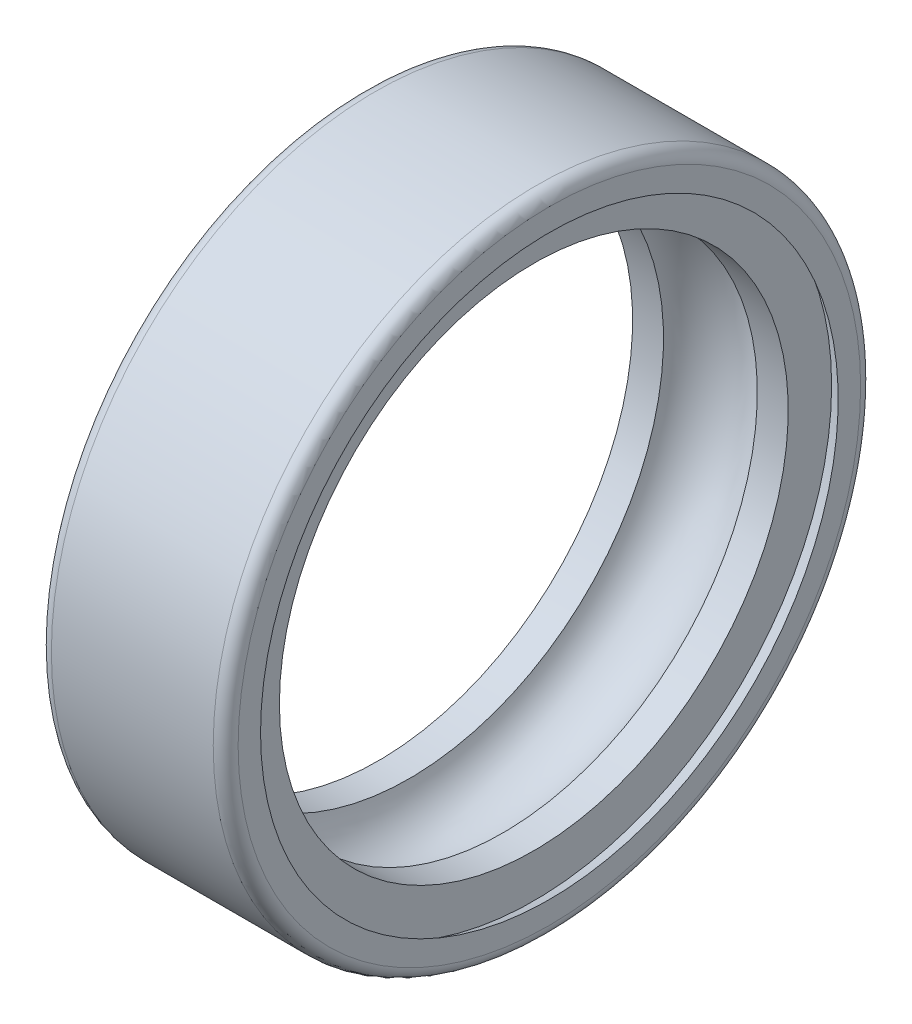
ISO-10303-21;
HEADER;
FILE_DESCRIPTION(('STEP AP214'),'2;1');
FILE_NAME('part.step','',(''),(''),'','','');
FILE_SCHEMA(('AUTOMOTIVE_DESIGN { 1 0 10303 214 1 1 1 1 }'));
ENDSEC;
DATA;
#1=APPLICATION_CONTEXT('core data for automotive mechanical design processes');
#2=APPLICATION_PROTOCOL_DEFINITION('international standard','automotive_design',2000,#1);
#3=PRODUCT_CONTEXT('',#1,'mechanical');
#4=PRODUCT('Part','Part','',(#3));
#5=PRODUCT_RELATED_PRODUCT_CATEGORY('part','',(#4));
#6=PRODUCT_DEFINITION_FORMATION('','',#4);
#7=PRODUCT_DEFINITION_CONTEXT('part definition',#1,'design');
#8=PRODUCT_DEFINITION('design','',#6,#7);
#9=PRODUCT_DEFINITION_SHAPE('','',#8);
#10=(LENGTH_UNIT() NAMED_UNIT(*) SI_UNIT(.MILLI.,.METRE.));
#11=(NAMED_UNIT(*) PLANE_ANGLE_UNIT() SI_UNIT($,.RADIAN.));
#12=(NAMED_UNIT(*) SI_UNIT($,.STERADIAN.) SOLID_ANGLE_UNIT());
#13=UNCERTAINTY_MEASURE_WITH_UNIT(LENGTH_MEASURE(1.E-05),#10,'distance_accuracy_value','');
#14=(GEOMETRIC_REPRESENTATION_CONTEXT(3) GLOBAL_UNCERTAINTY_ASSIGNED_CONTEXT((#13)) GLOBAL_UNIT_ASSIGNED_CONTEXT((#10,
#11,#12)) REPRESENTATION_CONTEXT('',''));
#15=CARTESIAN_POINT('',(0.,0.,0.));
#16=DIRECTION('',(0.,0.,1.));
#17=DIRECTION('',(1.,0.,0.));
#18=AXIS2_PLACEMENT_3D('',#15,#16,#17);
#19=CARTESIAN_POINT('',(0.,0.,0.));
#20=DIRECTION('',(-1.,0.,0.));
#21=DIRECTION('',(0.,0.,1.));
#22=AXIS2_PLACEMENT_3D('',#19,#20,#21);
#23=CYLINDRICAL_SURFACE('',#22,20.435);
#24=CARTESIAN_POINT('',(13.75,0.,0.));
#25=DIRECTION('',(-1.,0.,0.));
#26=DIRECTION('',(0.,0.,1.));
#27=AXIS2_PLACEMENT_3D('',#24,#25,#26);
#28=CIRCLE('',#27,20.435);
#29=CARTESIAN_POINT('',(13.75,0.,20.435));
#30=VERTEX_POINT('',#29);
#31=EDGE_CURVE('E10',#30,#30,#28,.T.);
#32=ORIENTED_EDGE('',*,*,#31,.F.);
#33=EDGE_LOOP('',(#32));
#34=FACE_BOUND('',#33,.T.);
#35=CARTESIAN_POINT('',(11.2680598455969,0.,0.));
#36=DIRECTION('',(-1.,0.,0.));
#37=DIRECTION('',(0.,0.,1.));
#38=AXIS2_PLACEMENT_3D('',#35,#36,#37);
#39=CIRCLE('',#38,20.435);
#40=CARTESIAN_POINT('',(11.2680598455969,0.,20.435));
#41=VERTEX_POINT('',#40);
#42=EDGE_CURVE('E68',#41,#41,#39,.T.);
#43=ORIENTED_EDGE('',*,*,#42,.T.);
#44=EDGE_LOOP('',(#43));
#45=FACE_BOUND('',#44,.T.);
#46=ADVANCED_FACE('F28',(#34,#45),#23,.F.);
#47=CARTESIAN_POINT('',(13.75,20.435,0.));
#48=DIRECTION('',(-1.,0.,0.));
#49=DIRECTION('',(0.,0.,1.));
#50=AXIS2_PLACEMENT_3D('',#47,#48,#49);
#51=PLANE('',#50);
#52=CARTESIAN_POINT('',(13.75,0.,0.));
#53=DIRECTION('',(-1.,0.,0.));
#54=DIRECTION('',(0.,0.,1.));
#55=AXIS2_PLACEMENT_3D('',#52,#53,#54);
#56=CIRCLE('',#55,23.9216876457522);
#57=CARTESIAN_POINT('',(13.75,0.,23.9216876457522));
#58=VERTEX_POINT('',#57);
#59=EDGE_CURVE('E34',#58,#58,#56,.T.);
#60=ORIENTED_EDGE('',*,*,#59,.F.);
#61=EDGE_LOOP('',(#60));
#62=FACE_BOUND('',#61,.T.);
#63=ORIENTED_EDGE('',*,*,#31,.T.);
#64=EDGE_LOOP('',(#63));
#65=FACE_BOUND('',#64,.T.);
#66=ADVANCED_FACE('F85',(#62,#65),#51,.F.);
#67=CARTESIAN_POINT('',(13.75,0.,0.));
#68=DIRECTION('',(-1.,0.,0.));
#69=DIRECTION('',(0.,0.,1.));
#70=AXIS2_PLACEMENT_3D('',#67,#68,#69);
#71=CONICAL_SURFACE('',#70,23.9216876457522,0.523598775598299);
#72=CARTESIAN_POINT('',(15.,0.,0.));
#73=DIRECTION('',(-1.,0.,0.));
#74=DIRECTION('',(0.,0.,1.));
#75=AXIS2_PLACEMENT_3D('',#72,#73,#74);
#76=CIRCLE('',#75,23.1999998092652);
#77=CARTESIAN_POINT('',(15.,0.,23.1999998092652));
#78=VERTEX_POINT('',#77);
#79=EDGE_CURVE('E38',#78,#78,#76,.T.);
#80=ORIENTED_EDGE('',*,*,#79,.F.);
#81=EDGE_LOOP('',(#80));
#82=FACE_BOUND('',#81,.T.);
#83=ORIENTED_EDGE('',*,*,#59,.T.);
#84=EDGE_LOOP('',(#83));
#85=FACE_BOUND('',#84,.T.);
#86=ADVANCED_FACE('F90',(#82,#85),#71,.F.);
#87=CARTESIAN_POINT('',(15.,23.1999998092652,0.));
#88=DIRECTION('',(-1.,0.,0.));
#89=DIRECTION('',(0.,0.,1.));
#90=AXIS2_PLACEMENT_3D('',#87,#88,#89);
#91=PLANE('',#90);
#92=CARTESIAN_POINT('',(15.,0.,0.));
#93=DIRECTION('',(-1.,0.,0.));
#94=DIRECTION('',(0.,0.,1.));
#95=AXIS2_PLACEMENT_3D('',#92,#93,#94);
#96=CIRCLE('',#95,25.);
#97=CARTESIAN_POINT('',(15.,0.,25.));
#98=VERTEX_POINT('',#97);
#99=EDGE_CURVE('E42',#98,#98,#96,.T.);
#100=ORIENTED_EDGE('',*,*,#99,.F.);
#101=EDGE_LOOP('',(#100));
#102=FACE_BOUND('',#101,.T.);
#103=ORIENTED_EDGE('',*,*,#79,.T.);
#104=EDGE_LOOP('',(#103));
#105=FACE_BOUND('',#104,.T.);
#106=ADVANCED_FACE('F95',(#102,#105),#91,.F.);
#107=CARTESIAN_POINT('',(14.,0.,0.));
#108=DIRECTION('',(-1.,0.,0.));
#109=DIRECTION('',(0.,0.,1.));
#110=AXIS2_PLACEMENT_3D('',#107,#108,#109);
#111=TOROIDAL_SURFACE('',#110,25.,1.);
#112=CARTESIAN_POINT('',(14.,0.,0.));
#113=DIRECTION('',(-1.,0.,0.));
#114=DIRECTION('',(0.,0.,1.));
#115=AXIS2_PLACEMENT_3D('',#112,#113,#114);
#116=CIRCLE('',#115,26.);
#117=CARTESIAN_POINT('',(14.,0.,26.));
#118=VERTEX_POINT('',#117);
#119=EDGE_CURVE('E47',#118,#118,#116,.T.);
#120=ORIENTED_EDGE('',*,*,#119,.F.);
#121=EDGE_LOOP('',(#120));
#122=FACE_BOUND('',#121,.T.);
#123=ORIENTED_EDGE('',*,*,#99,.T.);
#124=EDGE_LOOP('',(#123));
#125=FACE_BOUND('',#124,.T.);
#126=ADVANCED_FACE('F101',(#122,#125),#111,.T.);
#127=CARTESIAN_POINT('',(0.,0.,0.));
#128=DIRECTION('',(-1.,0.,0.));
#129=DIRECTION('',(0.,0.,1.));
#130=AXIS2_PLACEMENT_3D('',#127,#128,#129);
#131=CYLINDRICAL_SURFACE('',#130,26.);
#132=CARTESIAN_POINT('',(1.,0.,0.));
#133=DIRECTION('',(-1.,0.,0.));
#134=DIRECTION('',(0.,0.,1.));
#135=AXIS2_PLACEMENT_3D('',#132,#133,#134);
#136=CIRCLE('',#135,26.);
#137=CARTESIAN_POINT('',(1.,0.,26.));
#138=VERTEX_POINT('',#137);
#139=EDGE_CURVE('E50',#138,#138,#136,.T.);
#140=ORIENTED_EDGE('',*,*,#139,.F.);
#141=EDGE_LOOP('',(#140));
#142=FACE_BOUND('',#141,.T.);
#143=ORIENTED_EDGE('',*,*,#119,.T.);
#144=EDGE_LOOP('',(#143));
#145=FACE_BOUND('',#144,.T.);
#146=ADVANCED_FACE('F105',(#142,#145),#131,.T.);
#147=CARTESIAN_POINT('',(1.,0.,0.));
#148=DIRECTION('',(-1.,0.,0.));
#149=DIRECTION('',(0.,0.,1.));
#150=AXIS2_PLACEMENT_3D('',#147,#148,#149);
#151=TOROIDAL_SURFACE('',#150,25.,1.);
#152=CARTESIAN_POINT('',(0.,0.,0.));
#153=DIRECTION('',(-1.,0.,0.));
#154=DIRECTION('',(0.,0.,1.));
#155=AXIS2_PLACEMENT_3D('',#152,#153,#154);
#156=CIRCLE('',#155,25.);
#157=CARTESIAN_POINT('',(0.,0.,25.));
#158=VERTEX_POINT('',#157);
#159=EDGE_CURVE('E53',#158,#158,#156,.T.);
#160=ORIENTED_EDGE('',*,*,#159,.F.);
#161=EDGE_LOOP('',(#160));
#162=FACE_BOUND('',#161,.T.);
#163=ORIENTED_EDGE('',*,*,#139,.T.);
#164=EDGE_LOOP('',(#163));
#165=FACE_BOUND('',#164,.T.);
#166=ADVANCED_FACE('F109',(#162,#165),#151,.T.);
#167=CARTESIAN_POINT('',(0.,25.,0.));
#168=DIRECTION('',(1.,0.,0.));
#169=DIRECTION('',(0.,0.,-1.));
#170=AXIS2_PLACEMENT_3D('',#167,#168,#169);
#171=PLANE('',#170);
#172=CARTESIAN_POINT('',(0.,0.,0.));
#173=DIRECTION('',(-1.,0.,0.));
#174=DIRECTION('',(0.,0.,1.));
#175=AXIS2_PLACEMENT_3D('',#172,#173,#174);
#176=CIRCLE('',#175,23.1999998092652);
#177=CARTESIAN_POINT('',(0.,0.,23.1999998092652));
#178=VERTEX_POINT('',#177);
#179=EDGE_CURVE('E56',#178,#178,#176,.T.);
#180=ORIENTED_EDGE('',*,*,#179,.F.);
#181=EDGE_LOOP('',(#180));
#182=FACE_BOUND('',#181,.T.);
#183=ORIENTED_EDGE('',*,*,#159,.T.);
#184=EDGE_LOOP('',(#183));
#185=FACE_BOUND('',#184,.T.);
#186=ADVANCED_FACE('F113',(#182,#185),#171,.F.);
#187=CARTESIAN_POINT('',(0.,0.,0.));
#188=DIRECTION('',(1.,0.,0.));
#189=DIRECTION('',(0.,0.,-1.));
#190=AXIS2_PLACEMENT_3D('',#187,#188,#189);
#191=CONICAL_SURFACE('',#190,23.1999998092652,0.523598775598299);
#192=CARTESIAN_POINT('',(1.25,0.,0.));
#193=DIRECTION('',(-1.,0.,0.));
#194=DIRECTION('',(0.,0.,1.));
#195=AXIS2_PLACEMENT_3D('',#192,#193,#194);
#196=CIRCLE('',#195,23.9216876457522);
#197=CARTESIAN_POINT('',(1.25,0.,23.9216876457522));
#198=VERTEX_POINT('',#197);
#199=EDGE_CURVE('E59',#198,#198,#196,.T.);
#200=ORIENTED_EDGE('',*,*,#199,.F.);
#201=EDGE_LOOP('',(#200));
#202=FACE_BOUND('',#201,.T.);
#203=ORIENTED_EDGE('',*,*,#179,.T.);
#204=EDGE_LOOP('',(#203));
#205=FACE_BOUND('',#204,.T.);
#206=ADVANCED_FACE('F117',(#202,#205),#191,.F.);
#207=CARTESIAN_POINT('',(1.25,23.9216876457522,0.));
#208=DIRECTION('',(1.,0.,0.));
#209=DIRECTION('',(0.,0.,-1.));
#210=AXIS2_PLACEMENT_3D('',#207,#208,#209);
#211=PLANE('',#210);
#212=CARTESIAN_POINT('',(1.25,0.,0.));
#213=DIRECTION('',(-1.,0.,0.));
#214=DIRECTION('',(0.,0.,1.));
#215=AXIS2_PLACEMENT_3D('',#212,#213,#214);
#216=CIRCLE('',#215,20.435);
#217=CARTESIAN_POINT('',(1.25,0.,20.435));
#218=VERTEX_POINT('',#217);
#219=EDGE_CURVE('E62',#218,#218,#216,.T.);
#220=ORIENTED_EDGE('',*,*,#219,.F.);
#221=EDGE_LOOP('',(#220));
#222=FACE_BOUND('',#221,.T.);
#223=ORIENTED_EDGE('',*,*,#199,.T.);
#224=EDGE_LOOP('',(#223));
#225=FACE_BOUND('',#224,.T.);
#226=ADVANCED_FACE('F81',(#222,#225),#211,.F.);
#227=CARTESIAN_POINT('',(0.,0.,0.));
#228=DIRECTION('',(-1.,0.,0.));
#229=DIRECTION('',(0.,0.,1.));
#230=AXIS2_PLACEMENT_3D('',#227,#228,#229);
#231=CYLINDRICAL_SURFACE('',#230,20.435);
#232=CARTESIAN_POINT('',(3.73194015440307,0.,0.));
#233=DIRECTION('',(-1.,0.,0.));
#234=DIRECTION('',(0.,0.,1.));
#235=AXIS2_PLACEMENT_3D('',#232,#233,#234);
#236=CIRCLE('',#235,20.435);
#237=CARTESIAN_POINT('',(3.73194015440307,0.,20.435));
#238=VERTEX_POINT('',#237);
#239=EDGE_CURVE('E65',#238,#238,#236,.T.);
#240=ORIENTED_EDGE('',*,*,#239,.F.);
#241=EDGE_LOOP('',(#240));
#242=FACE_BOUND('',#241,.T.);
#243=ORIENTED_EDGE('',*,*,#219,.T.);
#244=EDGE_LOOP('',(#243));
#245=FACE_BOUND('',#244,.T.);
#246=ADVANCED_FACE('F75',(#242,#245),#231,.F.);
#247=CARTESIAN_POINT('',(7.5,0.,0.));
#248=DIRECTION('',(-1.,0.,0.));
#249=DIRECTION('',(0.,0.,1.));
#250=AXIS2_PLACEMENT_3D('',#247,#248,#249);
#251=TOROIDAL_SURFACE('',#250,19.25,3.95);
#252=ORIENTED_EDGE('',*,*,#239,.T.);
#253=EDGE_LOOP('',(#252));
#254=FACE_BOUND('',#253,.T.);
#255=ORIENTED_EDGE('',*,*,#42,.F.);
#256=EDGE_LOOP('',(#255));
#257=FACE_BOUND('',#256,.T.);
#258=ADVANCED_FACE('F73',(#254,#257),#251,.F.);
#259=CLOSED_SHELL('',(#46,#66,#86,#106,#126,#146,#166,#186,#206,#226,#246,#258));
#260=MANIFOLD_SOLID_BREP('B2',#259);
#261=ADVANCED_BREP_SHAPE_REPRESENTATION('',(#18,#260),#14);
#262=SHAPE_DEFINITION_REPRESENTATION(#9,#261);
ENDSEC;
END-ISO-10303-21;
